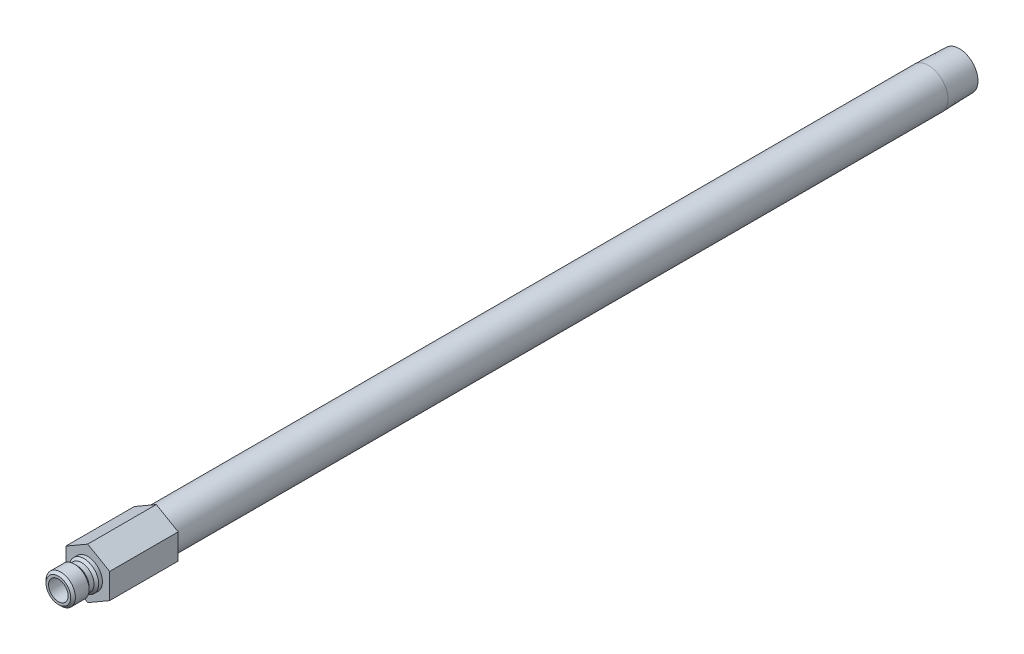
ISO-10303-21;
HEADER;
FILE_DESCRIPTION(('STEP AP214'),'2;1');
FILE_NAME('part.step','',(''),(''),'','','');
FILE_SCHEMA(('AUTOMOTIVE_DESIGN { 1 0 10303 214 1 1 1 1 }'));
ENDSEC;
DATA;
#1=APPLICATION_CONTEXT('core data for automotive mechanical design processes');
#2=APPLICATION_PROTOCOL_DEFINITION('international standard','automotive_design',2000,#1);
#3=PRODUCT_CONTEXT('',#1,'mechanical');
#4=PRODUCT('Part','Part','',(#3));
#5=PRODUCT_RELATED_PRODUCT_CATEGORY('part','',(#4));
#6=PRODUCT_DEFINITION_FORMATION('','',#4);
#7=PRODUCT_DEFINITION_CONTEXT('part definition',#1,'design');
#8=PRODUCT_DEFINITION('design','',#6,#7);
#9=PRODUCT_DEFINITION_SHAPE('','',#8);
#10=(LENGTH_UNIT() NAMED_UNIT(*) SI_UNIT(.MILLI.,.METRE.));
#11=(NAMED_UNIT(*) PLANE_ANGLE_UNIT() SI_UNIT($,.RADIAN.));
#12=(NAMED_UNIT(*) SI_UNIT($,.STERADIAN.) SOLID_ANGLE_UNIT());
#13=UNCERTAINTY_MEASURE_WITH_UNIT(LENGTH_MEASURE(1.E-05),#10,'distance_accuracy_value','');
#14=(GEOMETRIC_REPRESENTATION_CONTEXT(3) GLOBAL_UNCERTAINTY_ASSIGNED_CONTEXT((#13)) GLOBAL_UNIT_ASSIGNED_CONTEXT((#10,
#11,#12)) REPRESENTATION_CONTEXT('',''));
#15=CARTESIAN_POINT('',(0.,0.,0.));
#16=DIRECTION('',(0.,0.,1.));
#17=DIRECTION('',(1.,0.,0.));
#18=AXIS2_PLACEMENT_3D('',#15,#16,#17);
#19=CARTESIAN_POINT('',(0.,0.,0.));
#20=DIRECTION('',(0.,0.,-1.));
#21=DIRECTION('',(0.,1.,0.));
#22=AXIS2_PLACEMENT_3D('',#19,#20,#21);
#23=CYLINDRICAL_SURFACE('',#22,6.34999999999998);
#24=CARTESIAN_POINT('',(0.,0.,-272.542));
#25=DIRECTION('',(0.,0.,-1.));
#26=DIRECTION('',(0.,1.,0.));
#27=AXIS2_PLACEMENT_3D('',#24,#25,#26);
#28=CIRCLE('',#27,6.34999999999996);
#29=CARTESIAN_POINT('',(0.,6.35,-272.542));
#30=VERTEX_POINT('',#29);
#31=EDGE_CURVE('E42',#30,#30,#28,.T.);
#32=ORIENTED_EDGE('',*,*,#31,.F.);
#33=EDGE_LOOP('',(#32));
#34=FACE_BOUND('',#33,.T.);
#35=CARTESIAN_POINT('',(0.,0.,-22.225));
#36=DIRECTION('',(0.,0.,1.));
#37=DIRECTION('',(1.,0.,0.));
#38=AXIS2_PLACEMENT_3D('',#35,#36,#37);
#39=CIRCLE('',#38,6.34999999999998);
#40=CARTESIAN_POINT('',(6.34999999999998,0.,-22.225));
#41=VERTEX_POINT('',#40);
#42=EDGE_CURVE('E138',#41,#41,#39,.F.);
#43=ORIENTED_EDGE('',*,*,#42,.T.);
#44=EDGE_LOOP('',(#43));
#45=FACE_BOUND('',#44,.T.);
#46=ADVANCED_FACE('F33',(#34,#45),#23,.T.);
#47=CARTESIAN_POINT('',(0.,6.03647060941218,-282.575));
#48=DIRECTION('',(0.,0.,-1.));
#49=DIRECTION('',(0.,1.,0.));
#50=AXIS2_PLACEMENT_3D('',#47,#48,#49);
#51=PLANE('',#50);
#52=CARTESIAN_POINT('',(0.,0.,-282.575));
#53=DIRECTION('',(0.,0.,-1.));
#54=DIRECTION('',(0.,1.,0.));
#55=AXIS2_PLACEMENT_3D('',#52,#53,#54);
#56=CIRCLE('',#55,6.03647060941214);
#57=CARTESIAN_POINT('',(0.,6.03647060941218,-282.575));
#58=VERTEX_POINT('',#57);
#59=EDGE_CURVE('E11',#58,#58,#56,.T.);
#60=ORIENTED_EDGE('',*,*,#59,.T.);
#61=EDGE_LOOP('',(#60));
#62=FACE_BOUND('',#61,.T.);
#63=CARTESIAN_POINT('',(0.,0.,-282.575));
#64=DIRECTION('',(0.,0.,-1.));
#65=DIRECTION('',(0.,1.,0.));
#66=AXIS2_PLACEMENT_3D('',#63,#64,#65);
#67=CIRCLE('',#66,4.62279999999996);
#68=CARTESIAN_POINT('',(0.,4.6228,-282.575));
#69=VERTEX_POINT('',#68);
#70=EDGE_CURVE('E146',#69,#69,#67,.T.);
#71=ORIENTED_EDGE('',*,*,#70,.F.);
#72=EDGE_LOOP('',(#71));
#73=FACE_BOUND('',#72,.T.);
#74=ADVANCED_FACE('F35',(#62,#73),#51,.T.);
#75=CARTESIAN_POINT('',(0.,0.,-282.575));
#76=DIRECTION('',(0.,0.,1.));
#77=DIRECTION('',(0.,-1.,0.));
#78=AXIS2_PLACEMENT_3D('',#75,#76,#77);
#79=CONICAL_SURFACE('',#78,6.03647060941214,0.0312396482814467);
#80=ORIENTED_EDGE('',*,*,#31,.T.);
#81=EDGE_LOOP('',(#80));
#82=FACE_BOUND('',#81,.T.);
#83=ORIENTED_EDGE('',*,*,#59,.F.);
#84=EDGE_LOOP('',(#83));
#85=FACE_BOUND('',#84,.T.);
#86=ADVANCED_FACE('F181',(#82,#85),#79,.T.);
#87=CARTESIAN_POINT('',(0.,4.7625,0.));
#88=DIRECTION('',(0.,0.,1.));
#89=DIRECTION('',(0.,-1.,0.));
#90=AXIS2_PLACEMENT_3D('',#87,#88,#89);
#91=PLANE('',#90);
#92=CARTESIAN_POINT('',(0.,0.,0.));
#93=DIRECTION('',(0.,0.,-1.));
#94=DIRECTION('',(0.,1.,0.));
#95=AXIS2_PLACEMENT_3D('',#92,#93,#94);
#96=CIRCLE('',#95,4.7625);
#97=CARTESIAN_POINT('',(0.,4.7625,0.));
#98=VERTEX_POINT('',#97);
#99=EDGE_CURVE('E176',#98,#98,#96,.T.);
#100=ORIENTED_EDGE('',*,*,#99,.T.);
#101=EDGE_LOOP('',(#100));
#102=FACE_BOUND('',#101,.T.);
#103=DIRECTION('',(-0.866025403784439,-0.5,0.));
#104=VECTOR('',#103,1.);
#105=CARTESIAN_POINT('',(0.,8.21223022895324,0.));
#106=LINE('',#105,#104);
#107=CARTESIAN_POINT('',(0.,8.21223022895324,0.));
#108=VERTEX_POINT('',#107);
#109=CARTESIAN_POINT('',(-7.112,4.10611511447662,0.));
#110=VERTEX_POINT('',#109);
#111=EDGE_CURVE('E121',#108,#110,#106,.T.);
#112=ORIENTED_EDGE('',*,*,#111,.T.);
#113=DIRECTION('',(0.,-1.,0.));
#114=VECTOR('',#113,1.);
#115=CARTESIAN_POINT('',(-7.112,4.10611511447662,0.));
#116=LINE('',#115,#114);
#117=CARTESIAN_POINT('',(-7.112,-4.10611511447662,0.));
#118=VERTEX_POINT('',#117);
#119=EDGE_CURVE('E124',#110,#118,#116,.T.);
#120=ORIENTED_EDGE('',*,*,#119,.T.);
#121=DIRECTION('',(0.866025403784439,-0.5,0.));
#122=VECTOR('',#121,1.);
#123=CARTESIAN_POINT('',(-7.112,-4.10611511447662,0.));
#124=LINE('',#123,#122);
#125=CARTESIAN_POINT('',(0.,-8.21223022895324,0.));
#126=VERTEX_POINT('',#125);
#127=EDGE_CURVE('E127',#118,#126,#124,.T.);
#128=ORIENTED_EDGE('',*,*,#127,.T.);
#129=DIRECTION('',(0.866025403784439,0.5,0.));
#130=VECTOR('',#129,1.);
#131=CARTESIAN_POINT('',(0.,-8.21223022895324,0.));
#132=LINE('',#131,#130);
#133=CARTESIAN_POINT('',(7.112,-4.10611511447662,0.));
#134=VERTEX_POINT('',#133);
#135=EDGE_CURVE('E130',#126,#134,#132,.T.);
#136=ORIENTED_EDGE('',*,*,#135,.T.);
#137=DIRECTION('',(0.,1.,0.));
#138=VECTOR('',#137,1.);
#139=CARTESIAN_POINT('',(7.112,-4.10611511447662,0.));
#140=LINE('',#139,#138);
#141=CARTESIAN_POINT('',(7.112,4.10611511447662,0.));
#142=VERTEX_POINT('',#141);
#143=EDGE_CURVE('E98',#134,#142,#140,.T.);
#144=ORIENTED_EDGE('',*,*,#143,.T.);
#145=DIRECTION('',(-0.866025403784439,0.5,0.));
#146=VECTOR('',#145,1.);
#147=CARTESIAN_POINT('',(7.112,4.10611511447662,0.));
#148=LINE('',#147,#146);
#149=EDGE_CURVE('E133',#142,#108,#148,.T.);
#150=ORIENTED_EDGE('',*,*,#149,.T.);
#151=EDGE_LOOP('',(#112,#120,#128,#136,#144,#150));
#152=FACE_BOUND('',#151,.T.);
#153=ADVANCED_FACE('F250',(#102,#152),#91,.T.);
#154=CARTESIAN_POINT('',(0.,0.,0.));
#155=DIRECTION('',(0.,0.,-1.));
#156=DIRECTION('',(0.,1.,0.));
#157=AXIS2_PLACEMENT_3D('',#154,#155,#156);
#158=CYLINDRICAL_SURFACE('',#157,4.7625);
#159=CARTESIAN_POINT('',(0.,0.,1.2065));
#160=DIRECTION('',(0.,0.,-1.));
#161=DIRECTION('',(0.,1.,0.));
#162=AXIS2_PLACEMENT_3D('',#159,#160,#161);
#163=CIRCLE('',#162,4.7625);
#164=CARTESIAN_POINT('',(0.,4.7625,1.2065));
#165=VERTEX_POINT('',#164);
#166=EDGE_CURVE('E173',#165,#165,#163,.T.);
#167=ORIENTED_EDGE('',*,*,#166,.T.);
#168=EDGE_LOOP('',(#167));
#169=FACE_BOUND('',#168,.T.);
#170=ORIENTED_EDGE('',*,*,#99,.F.);
#171=EDGE_LOOP('',(#170));
#172=FACE_BOUND('',#171,.T.);
#173=ADVANCED_FACE('F246',(#169,#172),#158,.T.);
#174=CARTESIAN_POINT('',(0.,0.,1.2065));
#175=DIRECTION('',(0.,0.,-1.));
#176=DIRECTION('',(0.,1.,0.));
#177=AXIS2_PLACEMENT_3D('',#174,#175,#176);
#178=CONICAL_SURFACE('',#177,4.7625,0.785398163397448);
#179=CARTESIAN_POINT('',(0.,0.,1.9685));
#180=DIRECTION('',(0.,0.,-1.));
#181=DIRECTION('',(0.,1.,0.));
#182=AXIS2_PLACEMENT_3D('',#179,#180,#181);
#183=CIRCLE('',#182,4.0005);
#184=CARTESIAN_POINT('',(0.,4.0005,1.9685));
#185=VERTEX_POINT('',#184);
#186=EDGE_CURVE('E170',#185,#185,#183,.T.);
#187=ORIENTED_EDGE('',*,*,#186,.T.);
#188=EDGE_LOOP('',(#187));
#189=FACE_BOUND('',#188,.T.);
#190=ORIENTED_EDGE('',*,*,#166,.F.);
#191=EDGE_LOOP('',(#190));
#192=FACE_BOUND('',#191,.T.);
#193=ADVANCED_FACE('F242',(#189,#192),#178,.T.);
#194=CARTESIAN_POINT('',(0.,0.,0.));
#195=DIRECTION('',(0.,0.,-1.));
#196=DIRECTION('',(0.,1.,0.));
#197=AXIS2_PLACEMENT_3D('',#194,#195,#196);
#198=CYLINDRICAL_SURFACE('',#197,4.0005);
#199=CARTESIAN_POINT('',(0.,0.,3.556));
#200=DIRECTION('',(0.,0.,-1.));
#201=DIRECTION('',(0.,1.,0.));
#202=AXIS2_PLACEMENT_3D('',#199,#200,#201);
#203=CIRCLE('',#202,4.0005);
#204=CARTESIAN_POINT('',(0.,4.0005,3.556));
#205=VERTEX_POINT('',#204);
#206=EDGE_CURVE('E167',#205,#205,#203,.T.);
#207=ORIENTED_EDGE('',*,*,#206,.T.);
#208=EDGE_LOOP('',(#207));
#209=FACE_BOUND('',#208,.T.);
#210=ORIENTED_EDGE('',*,*,#186,.F.);
#211=EDGE_LOOP('',(#210));
#212=FACE_BOUND('',#211,.T.);
#213=ADVANCED_FACE('F238',(#209,#212),#198,.T.);
#214=CARTESIAN_POINT('',(0.,0.,3.556));
#215=DIRECTION('',(0.,0.,1.));
#216=DIRECTION('',(0.,-1.,0.));
#217=AXIS2_PLACEMENT_3D('',#214,#215,#216);
#218=CONICAL_SURFACE('',#217,4.0005,0.785398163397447);
#219=CARTESIAN_POINT('',(0.,0.,4.318));
#220=DIRECTION('',(0.,0.,-1.));
#221=DIRECTION('',(0.,1.,0.));
#222=AXIS2_PLACEMENT_3D('',#219,#220,#221);
#223=CIRCLE('',#222,4.7625);
#224=CARTESIAN_POINT('',(0.,4.7625,4.318));
#225=VERTEX_POINT('',#224);
#226=EDGE_CURVE('E164',#225,#225,#223,.T.);
#227=ORIENTED_EDGE('',*,*,#226,.T.);
#228=EDGE_LOOP('',(#227));
#229=FACE_BOUND('',#228,.T.);
#230=ORIENTED_EDGE('',*,*,#206,.F.);
#231=EDGE_LOOP('',(#230));
#232=FACE_BOUND('',#231,.T.);
#233=ADVANCED_FACE('F234',(#229,#232),#218,.T.);
#234=CARTESIAN_POINT('',(0.,0.,0.));
#235=DIRECTION('',(0.,0.,-1.));
#236=DIRECTION('',(0.,1.,0.));
#237=AXIS2_PLACEMENT_3D('',#234,#235,#236);
#238=CYLINDRICAL_SURFACE('',#237,4.7625);
#239=CARTESIAN_POINT('',(0.,0.,8.763));
#240=DIRECTION('',(0.,0.,-1.));
#241=DIRECTION('',(0.,1.,0.));
#242=AXIS2_PLACEMENT_3D('',#239,#240,#241);
#243=CIRCLE('',#242,4.7625);
#244=CARTESIAN_POINT('',(0.,4.7625,8.763));
#245=VERTEX_POINT('',#244);
#246=EDGE_CURVE('E161',#245,#245,#243,.T.);
#247=ORIENTED_EDGE('',*,*,#246,.T.);
#248=EDGE_LOOP('',(#247));
#249=FACE_BOUND('',#248,.T.);
#250=ORIENTED_EDGE('',*,*,#226,.F.);
#251=EDGE_LOOP('',(#250));
#252=FACE_BOUND('',#251,.T.);
#253=ADVANCED_FACE('F230',(#249,#252),#238,.T.);
#254=CARTESIAN_POINT('',(0.,0.,8.763));
#255=DIRECTION('',(0.,0.,-1.));
#256=DIRECTION('',(0.,1.,0.));
#257=AXIS2_PLACEMENT_3D('',#254,#255,#256);
#258=CONICAL_SURFACE('',#257,4.7625,0.785398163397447);
#259=CARTESIAN_POINT('',(0.,0.,9.525));
#260=DIRECTION('',(0.,0.,-1.));
#261=DIRECTION('',(0.,1.,0.));
#262=AXIS2_PLACEMENT_3D('',#259,#260,#261);
#263=CIRCLE('',#262,4.0005);
#264=CARTESIAN_POINT('',(0.,4.0005,9.525));
#265=VERTEX_POINT('',#264);
#266=EDGE_CURVE('E158',#265,#265,#263,.T.);
#267=ORIENTED_EDGE('',*,*,#266,.T.);
#268=EDGE_LOOP('',(#267));
#269=FACE_BOUND('',#268,.T.);
#270=ORIENTED_EDGE('',*,*,#246,.F.);
#271=EDGE_LOOP('',(#270));
#272=FACE_BOUND('',#271,.T.);
#273=ADVANCED_FACE('F226',(#269,#272),#258,.T.);
#274=CARTESIAN_POINT('',(0.,3.175,9.525));
#275=DIRECTION('',(0.,0.,1.));
#276=DIRECTION('',(0.,-1.,0.));
#277=AXIS2_PLACEMENT_3D('',#274,#275,#276);
#278=PLANE('',#277);
#279=CARTESIAN_POINT('',(0.,0.,9.525));
#280=DIRECTION('',(0.,0.,-1.));
#281=DIRECTION('',(0.,1.,0.));
#282=AXIS2_PLACEMENT_3D('',#279,#280,#281);
#283=CIRCLE('',#282,3.175);
#284=CARTESIAN_POINT('',(0.,3.175,9.525));
#285=VERTEX_POINT('',#284);
#286=EDGE_CURVE('E155',#285,#285,#283,.T.);
#287=ORIENTED_EDGE('',*,*,#286,.T.);
#288=EDGE_LOOP('',(#287));
#289=FACE_BOUND('',#288,.T.);
#290=ORIENTED_EDGE('',*,*,#266,.F.);
#291=EDGE_LOOP('',(#290));
#292=FACE_BOUND('',#291,.T.);
#293=ADVANCED_FACE('F222',(#289,#292),#278,.T.);
#294=CARTESIAN_POINT('',(0.,0.,0.));
#295=DIRECTION('',(0.,0.,-1.));
#296=DIRECTION('',(0.,1.,0.));
#297=AXIS2_PLACEMENT_3D('',#294,#295,#296);
#298=CYLINDRICAL_SURFACE('',#297,3.175);
#299=ORIENTED_EDGE('',*,*,#286,.F.);
#300=EDGE_LOOP('',(#299));
#301=FACE_BOUND('',#300,.T.);
#302=CARTESIAN_POINT('',(0.,0.,-22.225));
#303=DIRECTION('',(0.,0.,-1.));
#304=DIRECTION('',(0.,1.,0.));
#305=AXIS2_PLACEMENT_3D('',#302,#303,#304);
#306=CIRCLE('',#305,3.175);
#307=CARTESIAN_POINT('',(0.,3.175,-22.225));
#308=VERTEX_POINT('',#307);
#309=EDGE_CURVE('E152',#308,#308,#306,.T.);
#310=ORIENTED_EDGE('',*,*,#309,.T.);
#311=EDGE_LOOP('',(#310));
#312=FACE_BOUND('',#311,.T.);
#313=ADVANCED_FACE('F218',(#301,#312),#298,.F.);
#314=CARTESIAN_POINT('',(0.,4.6228,-22.225));
#315=DIRECTION('',(0.,0.,-1.));
#316=DIRECTION('',(0.,1.,0.));
#317=AXIS2_PLACEMENT_3D('',#314,#315,#316);
#318=PLANE('',#317);
#319=CARTESIAN_POINT('',(0.,0.,-22.225));
#320=DIRECTION('',(0.,0.,-1.));
#321=DIRECTION('',(0.,1.,0.));
#322=AXIS2_PLACEMENT_3D('',#319,#320,#321);
#323=CIRCLE('',#322,4.6228);
#324=CARTESIAN_POINT('',(0.,4.6228,-22.225));
#325=VERTEX_POINT('',#324);
#326=EDGE_CURVE('E149',#325,#325,#323,.T.);
#327=ORIENTED_EDGE('',*,*,#326,.T.);
#328=EDGE_LOOP('',(#327));
#329=FACE_BOUND('',#328,.T.);
#330=ORIENTED_EDGE('',*,*,#309,.F.);
#331=EDGE_LOOP('',(#330));
#332=FACE_BOUND('',#331,.T.);
#333=ADVANCED_FACE('F199',(#329,#332),#318,.T.);
#334=CARTESIAN_POINT('',(0.,0.,0.));
#335=DIRECTION('',(0.,0.,-1.));
#336=DIRECTION('',(0.,1.,0.));
#337=AXIS2_PLACEMENT_3D('',#334,#335,#336);
#338=CYLINDRICAL_SURFACE('',#337,4.62279999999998);
#339=ORIENTED_EDGE('',*,*,#70,.T.);
#340=EDGE_LOOP('',(#339));
#341=FACE_BOUND('',#340,.T.);
#342=ORIENTED_EDGE('',*,*,#326,.F.);
#343=EDGE_LOOP('',(#342));
#344=FACE_BOUND('',#343,.T.);
#345=ADVANCED_FACE('F191',(#341,#344),#338,.F.);
#346=CARTESIAN_POINT('',(-7.112,4.10611511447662,-22.225));
#347=DIRECTION('',(0.,0.,1.));
#348=DIRECTION('',(1.,0.,0.));
#349=AXIS2_PLACEMENT_3D('',#346,#347,#348);
#350=PLANE('',#349);
#351=ORIENTED_EDGE('',*,*,#42,.F.);
#352=EDGE_LOOP('',(#351));
#353=FACE_BOUND('',#352,.T.);
#354=DIRECTION('',(-0.866025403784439,-0.5,0.));
#355=VECTOR('',#354,1.);
#356=CARTESIAN_POINT('',(0.,8.21223022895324,-22.225));
#357=LINE('',#356,#355);
#358=CARTESIAN_POINT('',(0.,8.21223022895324,-22.225));
#359=VERTEX_POINT('',#358);
#360=CARTESIAN_POINT('',(-7.112,4.10611511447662,-22.225));
#361=VERTEX_POINT('',#360);
#362=EDGE_CURVE('E136',#359,#361,#357,.T.);
#363=ORIENTED_EDGE('',*,*,#362,.F.);
#364=DIRECTION('',(-0.866025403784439,0.5,0.));
#365=VECTOR('',#364,1.);
#366=CARTESIAN_POINT('',(7.112,4.10611511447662,-22.225));
#367=LINE('',#366,#365);
#368=CARTESIAN_POINT('',(7.112,4.10611511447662,-22.225));
#369=VERTEX_POINT('',#368);
#370=EDGE_CURVE('E111',#369,#359,#367,.T.);
#371=ORIENTED_EDGE('',*,*,#370,.F.);
#372=DIRECTION('',(0.,1.,0.));
#373=VECTOR('',#372,1.);
#374=CARTESIAN_POINT('',(7.112,-4.10611511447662,-22.225));
#375=LINE('',#374,#373);
#376=CARTESIAN_POINT('',(7.112,-4.10611511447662,-22.225));
#377=VERTEX_POINT('',#376);
#378=EDGE_CURVE('E96',#377,#369,#375,.T.);
#379=ORIENTED_EDGE('',*,*,#378,.F.);
#380=DIRECTION('',(0.866025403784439,0.5,0.));
#381=VECTOR('',#380,1.);
#382=CARTESIAN_POINT('',(0.,-8.21223022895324,-22.225));
#383=LINE('',#382,#381);
#384=CARTESIAN_POINT('',(0.,-8.21223022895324,-22.225));
#385=VERTEX_POINT('',#384);
#386=EDGE_CURVE('E109',#385,#377,#383,.T.);
#387=ORIENTED_EDGE('',*,*,#386,.F.);
#388=DIRECTION('',(0.866025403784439,-0.5,0.));
#389=VECTOR('',#388,1.);
#390=CARTESIAN_POINT('',(-7.112,-4.10611511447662,-22.225));
#391=LINE('',#390,#389);
#392=CARTESIAN_POINT('',(-7.112,-4.10611511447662,-22.225));
#393=VERTEX_POINT('',#392);
#394=EDGE_CURVE('E114',#393,#385,#391,.T.);
#395=ORIENTED_EDGE('',*,*,#394,.F.);
#396=DIRECTION('',(0.,-1.,0.));
#397=VECTOR('',#396,1.);
#398=CARTESIAN_POINT('',(-7.112,4.10611511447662,-22.225));
#399=LINE('',#398,#397);
#400=EDGE_CURVE('E116',#361,#393,#399,.T.);
#401=ORIENTED_EDGE('',*,*,#400,.F.);
#402=EDGE_LOOP('',(#363,#371,#379,#387,#395,#401));
#403=FACE_BOUND('',#402,.T.);
#404=ADVANCED_FACE('F107',(#353,#403),#350,.F.);
#405=CARTESIAN_POINT('',(0.,8.21223022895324,-22.225));
#406=DIRECTION('',(-0.5,0.866025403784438,0.));
#407=DIRECTION('',(-0.866025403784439,-0.5,0.));
#408=AXIS2_PLACEMENT_3D('',#405,#406,#407);
#409=PLANE('',#408);
#410=ORIENTED_EDGE('',*,*,#111,.F.);
#411=DIRECTION('',(0.,0.,1.));
#412=VECTOR('',#411,1.);
#413=CARTESIAN_POINT('',(0.,8.21223022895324,-22.225));
#414=LINE('',#413,#412);
#415=EDGE_CURVE('E50',#359,#108,#414,.T.);
#416=ORIENTED_EDGE('',*,*,#415,.F.);
#417=ORIENTED_EDGE('',*,*,#362,.T.);
#418=DIRECTION('',(0.,0.,1.));
#419=VECTOR('',#418,1.);
#420=CARTESIAN_POINT('',(-7.112,4.10611511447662,-22.225));
#421=LINE('',#420,#419);
#422=EDGE_CURVE('E85',#361,#110,#421,.T.);
#423=ORIENTED_EDGE('',*,*,#422,.T.);
#424=EDGE_LOOP('',(#410,#416,#417,#423));
#425=FACE_BOUND('',#424,.T.);
#426=ADVANCED_FACE('F190',(#425),#409,.T.);
#427=CARTESIAN_POINT('',(7.112,4.10611511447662,-22.225));
#428=DIRECTION('',(0.5,0.866025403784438,0.));
#429=DIRECTION('',(-0.866025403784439,0.5,0.));
#430=AXIS2_PLACEMENT_3D('',#427,#428,#429);
#431=PLANE('',#430);
#432=ORIENTED_EDGE('',*,*,#149,.F.);
#433=DIRECTION('',(0.,0.,1.));
#434=VECTOR('',#433,1.);
#435=CARTESIAN_POINT('',(7.112,4.10611511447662,-22.225));
#436=LINE('',#435,#434);
#437=EDGE_CURVE('E73',#369,#142,#436,.T.);
#438=ORIENTED_EDGE('',*,*,#437,.F.);
#439=ORIENTED_EDGE('',*,*,#370,.T.);
#440=ORIENTED_EDGE('',*,*,#415,.T.);
#441=EDGE_LOOP('',(#432,#438,#439,#440));
#442=FACE_BOUND('',#441,.T.);
#443=ADVANCED_FACE('F197',(#442),#431,.T.);
#444=CARTESIAN_POINT('',(7.112,-4.10611511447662,-22.225));
#445=DIRECTION('',(1.,0.,0.));
#446=DIRECTION('',(0.,1.,0.));
#447=AXIS2_PLACEMENT_3D('',#444,#445,#446);
#448=PLANE('',#447);
#449=ORIENTED_EDGE('',*,*,#143,.F.);
#450=DIRECTION('',(0.,0.,1.));
#451=VECTOR('',#450,1.);
#452=CARTESIAN_POINT('',(7.112,-4.10611511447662,-22.225));
#453=LINE('',#452,#451);
#454=EDGE_CURVE('E93',#377,#134,#453,.T.);
#455=ORIENTED_EDGE('',*,*,#454,.F.);
#456=ORIENTED_EDGE('',*,*,#378,.T.);
#457=ORIENTED_EDGE('',*,*,#437,.T.);
#458=EDGE_LOOP('',(#449,#455,#456,#457));
#459=FACE_BOUND('',#458,.T.);
#460=ADVANCED_FACE('F95',(#459),#448,.T.);
#461=CARTESIAN_POINT('',(0.,-8.21223022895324,-22.225));
#462=DIRECTION('',(0.5,-0.866025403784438,0.));
#463=DIRECTION('',(0.866025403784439,0.5,0.));
#464=AXIS2_PLACEMENT_3D('',#461,#462,#463);
#465=PLANE('',#464);
#466=ORIENTED_EDGE('',*,*,#135,.F.);
#467=DIRECTION('',(0.,0.,1.));
#468=VECTOR('',#467,1.);
#469=CARTESIAN_POINT('',(0.,-8.21223022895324,-22.225));
#470=LINE('',#469,#468);
#471=EDGE_CURVE('E103',#385,#126,#470,.T.);
#472=ORIENTED_EDGE('',*,*,#471,.F.);
#473=ORIENTED_EDGE('',*,*,#386,.T.);
#474=ORIENTED_EDGE('',*,*,#454,.T.);
#475=EDGE_LOOP('',(#466,#472,#473,#474));
#476=FACE_BOUND('',#475,.T.);
#477=ADVANCED_FACE('F113',(#476),#465,.T.);
#478=CARTESIAN_POINT('',(-7.112,-4.10611511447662,-22.225));
#479=DIRECTION('',(-0.5,-0.866025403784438,0.));
#480=DIRECTION('',(0.866025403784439,-0.5,0.));
#481=AXIS2_PLACEMENT_3D('',#478,#479,#480);
#482=PLANE('',#481);
#483=ORIENTED_EDGE('',*,*,#127,.F.);
#484=DIRECTION('',(0.,0.,1.));
#485=VECTOR('',#484,1.);
#486=CARTESIAN_POINT('',(-7.112,-4.10611511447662,-22.225));
#487=LINE('',#486,#485);
#488=EDGE_CURVE('E141',#393,#118,#487,.T.);
#489=ORIENTED_EDGE('',*,*,#488,.F.);
#490=ORIENTED_EDGE('',*,*,#394,.T.);
#491=ORIENTED_EDGE('',*,*,#471,.T.);
#492=EDGE_LOOP('',(#483,#489,#490,#491));
#493=FACE_BOUND('',#492,.T.);
#494=ADVANCED_FACE('F209',(#493),#482,.T.);
#495=CARTESIAN_POINT('',(-7.112,4.10611511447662,-22.225));
#496=DIRECTION('',(-1.,0.,0.));
#497=DIRECTION('',(0.,0.,1.));
#498=AXIS2_PLACEMENT_3D('',#495,#496,#497);
#499=PLANE('',#498);
#500=ORIENTED_EDGE('',*,*,#119,.F.);
#501=ORIENTED_EDGE('',*,*,#422,.F.);
#502=ORIENTED_EDGE('',*,*,#400,.T.);
#503=ORIENTED_EDGE('',*,*,#488,.T.);
#504=EDGE_LOOP('',(#500,#501,#502,#503));
#505=FACE_BOUND('',#504,.T.);
#506=ADVANCED_FACE('F212',(#505),#499,.T.);
#507=CLOSED_SHELL('',(#46,#74,#86,#153,#173,#193,#213,#233,#253,#273,#293,#313,#333,#345,#404,
#426,#443,#460,#477,#494,#506));
#508=MANIFOLD_SOLID_BREP('B2',#507);
#509=ADVANCED_BREP_SHAPE_REPRESENTATION('',(#18,#508),#14);
#510=SHAPE_DEFINITION_REPRESENTATION(#9,#509);
ENDSEC;
END-ISO-10303-21;
